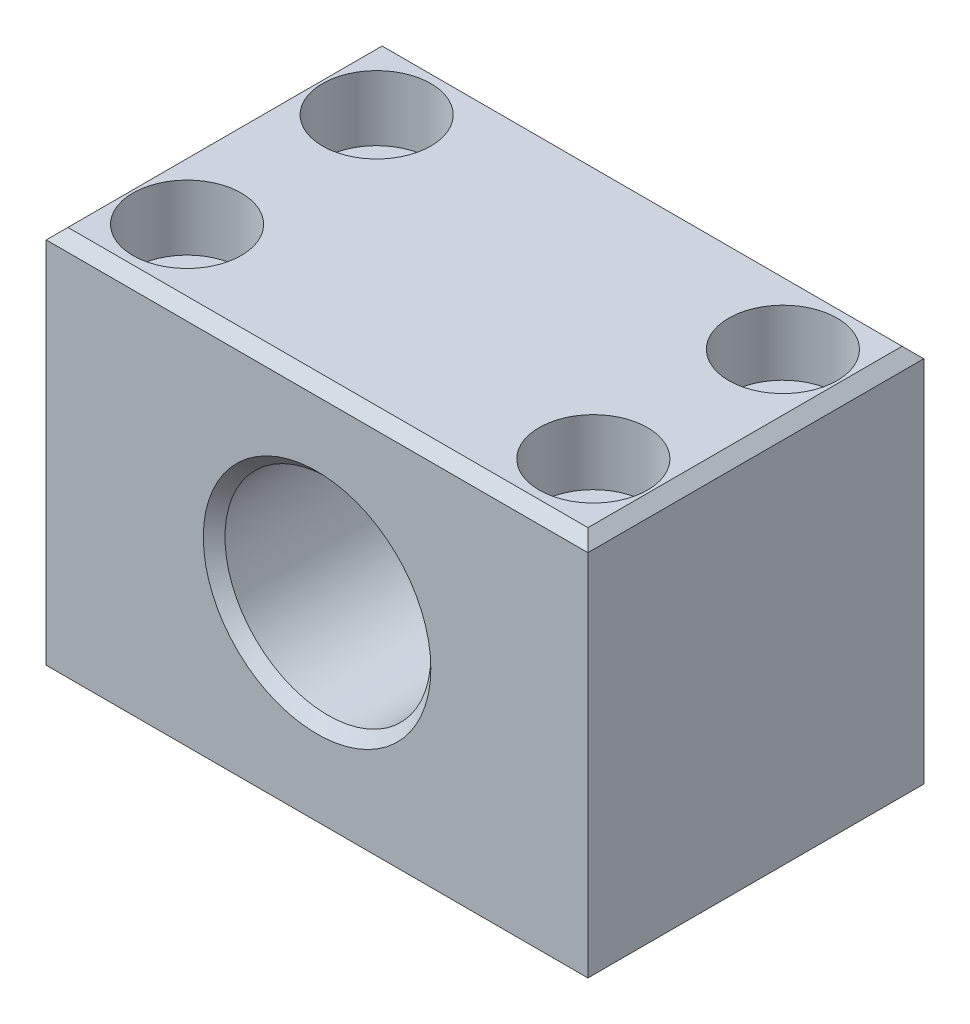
from build123d import *

# Parameters (mm, degrees)
ESQUISSE1_W                                        = 100
ESQUISSE1_H                                        = 70
BOSS_EXTRU_1_DEPTH                                 = 31
ESQUISSE2_R                                        = 19
ENL_V_MAT_EXTRU_1_DEPTH                            = 88
CHANFREIN1_SIZE                                    = 2
CHAMBRAGE_POUR_VIS_T_TE_HEXAGONALE_M12_D           = 12.2
CHAMBRAGE_POUR_VIS_T_TE_HEXAGONALE_M12_CBORE_D     = 20
CHAMBRAGE_POUR_VIS_T_TE_HEXAGONALE_M12_CBORE_DEPTH = 12
R_P_TITION_LIN_AIRE1_COUNT                         = 2
R_P_TITION_LIN_AIRE1_PITCH                         = 75
R_P_TITION_LIN_AIRE1_COUNT_DIR2                    = 2
R_P_TITION_LIN_AIRE1_PITCH_DIR2                    = 35


with BuildPart() as part:
    # Esquisse1 → Boss.-Extru.1 (new, symmetric)
    with BuildSketch(Plane.XY):
        Rectangle(ESQUISSE1_W, ESQUISSE1_H)
    extrude(amount=BOSS_EXTRU_1_DEPTH, both=True)

    # Esquisse2 → Enl_v. mat.-Extru.1 (cut, through all)
    with BuildSketch(Plane.XY.offset(31)):
        Circle(ESQUISSE2_R)
    extrude(amount=-ENL_V_MAT_EXTRU_1_DEPTH, mode=Mode.SUBTRACT)

    # Chanfrein1
    chanfrein1_edges = [part.edges().sort_by_distance(p)[0] for p in [
        (0, 35, 31),
        (-19, 0, -31),
        (-19, 0, 31),
        (0, 35, -31),
        (-50, 35, 0),
        (50, 35, 0),
    ]]
    chamfer(chanfrein1_edges, length=CHANFREIN1_SIZE)

    # Chambrage pour vis _ t_te hexagonale M12 (through all)
    with Locations(Plane(origin=(0, 35, 0), x_dir=(1, 0, 0), z_dir=(0, 1, 0))):
        with Locations((-37.5, 17.5)):
            chambrage_pour_vis_t_te_hexagonale_m12 = CounterBoreHole(CHAMBRAGE_POUR_VIS_T_TE_HEXAGONALE_M12_D / 2, CHAMBRAGE_POUR_VIS_T_TE_HEXAGONALE_M12_CBORE_D / 2, CHAMBRAGE_POUR_VIS_T_TE_HEXAGONALE_M12_CBORE_DEPTH)

    # R_p_tition lin_aire1: Chambrage pour vis _ t_te hexagonale M12 2 × 2
    with Locations(*[(i * R_P_TITION_LIN_AIRE1_PITCH, 0, j * R_P_TITION_LIN_AIRE1_PITCH_DIR2) for i in range(R_P_TITION_LIN_AIRE1_COUNT) for j in range(R_P_TITION_LIN_AIRE1_COUNT_DIR2) if (i, j) != (0, 0)]):
        add(chambrage_pour_vis_t_te_hexagonale_m12, mode=Mode.SUBTRACT)


solid = part.part
